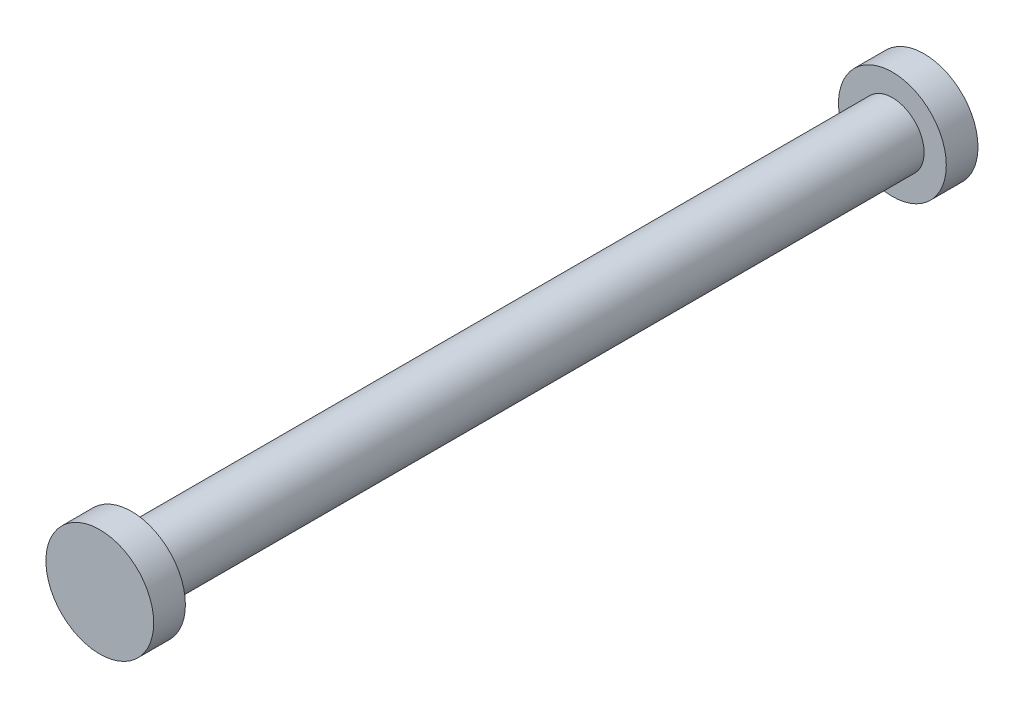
from build123d import *

# Parameters (mm, degrees)
EJE_PROFILE_R         = 5
TUERCA_DCHA_PROFILE_R = 8.5
TUERCA_IZQ_PROFILE_R  = 8.5


with BuildPart() as part:
    # Eje: sweep along a curve in space
    with BuildLine() as eje_path:
        Line((-425.1, 65, -65), (-425.1, 65, 65))
    # Eje profile (on start of the path) → Eje (sweep)
    with BuildSketch(Plane(origin=(-425.1, 65, -65), x_dir=(1, 0, 0), z_dir=(0, 0, 1))):
        Circle(EJE_PROFILE_R)
    sweep(path=eje_path.line)

    # Tuerca_dcha: sweep along a curve in space
    with BuildLine() as tuerca_dcha_path:
        Line((-425.1, 65, 60), (-425.1, 65, 65))
    # Tuerca_dcha profile (on start of the path) → Tuerca_dcha (sweep)
    with BuildSketch(Plane(origin=(-425.1, 65, 60), x_dir=(1, 0, 0), z_dir=(0, 0, 1))):
        Circle(TUERCA_DCHA_PROFILE_R)
    sweep(path=tuerca_dcha_path.line)

    # Tuerca_izq: sweep along a curve in space
    with BuildLine() as tuerca_izq_path:
        Line((-425.1, 65, -65), (-425.1, 65, -60))
    # Tuerca_izq profile (on start of the path) → Tuerca_izq (sweep)
    with BuildSketch(Plane(origin=(-425.1, 65, -65), x_dir=(1, 0, 0), z_dir=(0, 0, 1))):
        Circle(TUERCA_IZQ_PROFILE_R)
    sweep(path=tuerca_izq_path.line)


solid = part.part
